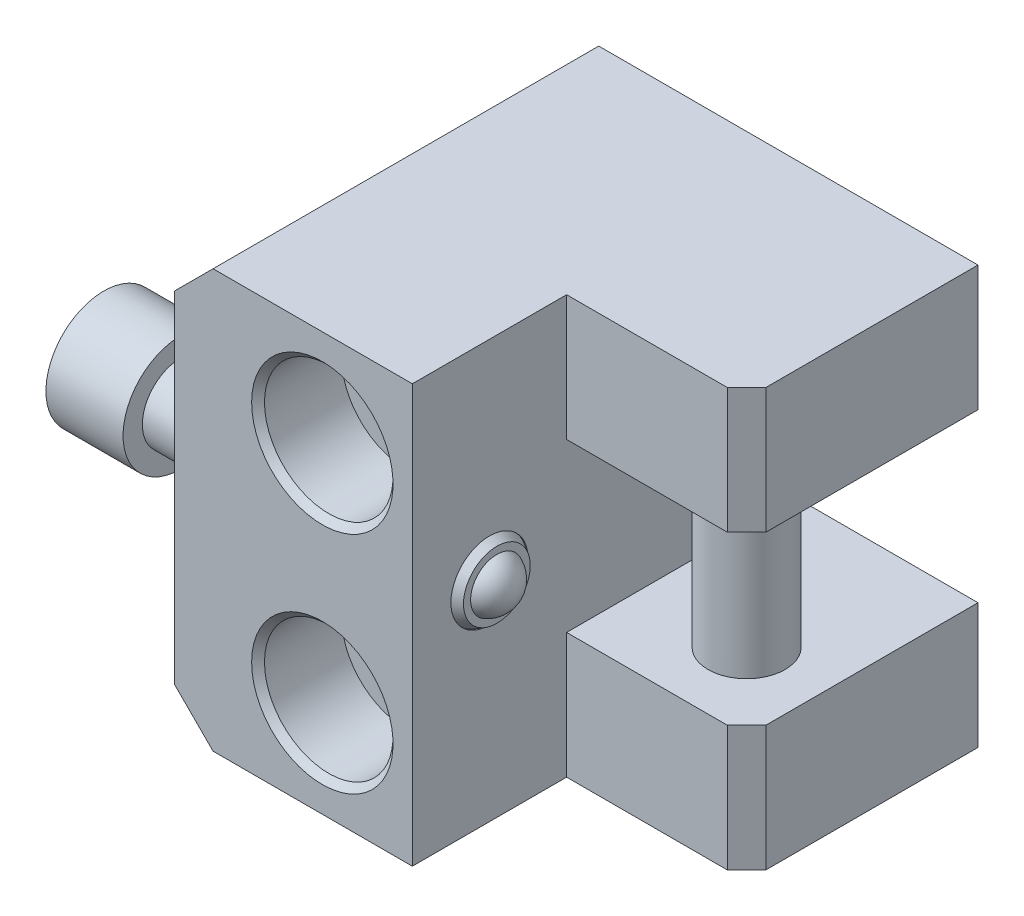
ISO-10303-21;
HEADER;
FILE_DESCRIPTION(('STEP AP214'),'2;1');
FILE_NAME('part.step','',(''),(''),'','','');
FILE_SCHEMA(('AUTOMOTIVE_DESIGN { 1 0 10303 214 1 1 1 1 }'));
ENDSEC;
DATA;
#1=APPLICATION_CONTEXT('core data for automotive mechanical design processes');
#2=APPLICATION_PROTOCOL_DEFINITION('international standard','automotive_design',2000,#1);
#3=PRODUCT_CONTEXT('',#1,'mechanical');
#4=PRODUCT('Part','Part','',(#3));
#5=PRODUCT_RELATED_PRODUCT_CATEGORY('part','',(#4));
#6=PRODUCT_DEFINITION_FORMATION('','',#4);
#7=PRODUCT_DEFINITION_CONTEXT('part definition',#1,'design');
#8=PRODUCT_DEFINITION('design','',#6,#7);
#9=PRODUCT_DEFINITION_SHAPE('','',#8);
#10=(LENGTH_UNIT() NAMED_UNIT(*) SI_UNIT(.MILLI.,.METRE.));
#11=(NAMED_UNIT(*) PLANE_ANGLE_UNIT() SI_UNIT($,.RADIAN.));
#12=(NAMED_UNIT(*) SI_UNIT($,.STERADIAN.) SOLID_ANGLE_UNIT());
#13=UNCERTAINTY_MEASURE_WITH_UNIT(LENGTH_MEASURE(1.E-05),#10,'distance_accuracy_value','');
#14=(GEOMETRIC_REPRESENTATION_CONTEXT(3) GLOBAL_UNCERTAINTY_ASSIGNED_CONTEXT((#13)) GLOBAL_UNIT_ASSIGNED_CONTEXT((#10,
#11,#12)) REPRESENTATION_CONTEXT('',''));
#15=CARTESIAN_POINT('',(0.,0.,0.));
#16=DIRECTION('',(0.,0.,1.));
#17=DIRECTION('',(1.,0.,0.));
#18=AXIS2_PLACEMENT_3D('',#15,#16,#17);
#19=CARTESIAN_POINT('',(-40.0000000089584,21.8385187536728,57.009842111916));
#20=DIRECTION('',(1.,4.10206021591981E-10,0.));
#21=DIRECTION('',(3.06687090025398E-11,-0.0747653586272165,0.99720115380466));
#22=AXIS2_PLACEMENT_3D('',#19,#20,#21);
#23=PLANE('',#22);
#24=DIRECTION('',(-3.69588857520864E-10,0.900984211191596,-0.433851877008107));
#25=VECTOR('',#24,1.);
#26=CARTESIAN_POINT('',(-40.0000000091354,22.2701767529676,51.2524985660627));
#27=LINE('',#26,#25);
#28=CARTESIAN_POINT('',(-40.0000000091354,22.2701767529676,51.2524985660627));
#29=VERTEX_POINT('',#28);
#30=CARTESIAN_POINT('',(-40.0000000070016,17.0683419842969,53.7573435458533));
#31=VERTEX_POINT('',#30);
#32=EDGE_CURVE('E162',#29,#31,#27,.F.);
#33=ORIENTED_EDGE('',*,*,#32,.F.);
#34=DIRECTION('',(-3.06687090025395E-11,0.074765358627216,-0.99720115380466));
#35=VECTOR('',#34,1.);
#36=CARTESIAN_POINT('',(-40.0000000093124,22.7018347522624,45.4951550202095));
#37=LINE('',#36,#35);
#38=CARTESIAN_POINT('',(-40.0000000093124,22.7018347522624,45.4951550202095));
#39=VERTEX_POINT('',#38);
#40=EDGE_CURVE('E177',#39,#29,#37,.F.);
#41=ORIENTED_EDGE('',*,*,#40,.F.);
#42=DIRECTION('',(-3.38920148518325E-10,0.82621885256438,0.563349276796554));
#43=VECTOR('',#42,1.);
#44=CARTESIAN_POINT('',(-40.0000000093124,22.7018347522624,45.4951550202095));
#45=LINE('',#44,#43);
#46=CARTESIAN_POINT('',(-40.0000000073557,17.9316579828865,42.2426564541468));
#47=VERTEX_POINT('',#46);
#48=EDGE_CURVE('E861',#39,#47,#45,.F.);
#49=ORIENTED_EDGE('',*,*,#48,.T.);
#50=DIRECTION('',(3.69588857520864E-10,-0.900984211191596,0.433851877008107));
#51=VECTOR('',#50,1.);
#52=CARTESIAN_POINT('',(-40.0000000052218,12.7298232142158,44.7475014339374));
#53=LINE('',#52,#51);
#54=CARTESIAN_POINT('',(-40.0000000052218,12.7298232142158,44.7475014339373));
#55=VERTEX_POINT('',#54);
#56=EDGE_CURVE('E864',#55,#47,#53,.F.);
#57=ORIENTED_EDGE('',*,*,#56,.F.);
#58=DIRECTION('',(-3.06687090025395E-11,0.074765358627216,-0.99720115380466));
#59=VECTOR('',#58,1.);
#60=CARTESIAN_POINT('',(-40.0000000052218,12.7298232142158,44.7475014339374));
#61=LINE('',#60,#59);
#62=CARTESIAN_POINT('',(-40.0000000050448,12.298165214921,50.5048449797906));
#63=VERTEX_POINT('',#62);
#64=EDGE_CURVE('E149',#55,#63,#61,.F.);
#65=ORIENTED_EDGE('',*,*,#64,.T.);
#66=DIRECTION('',(3.38920148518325E-10,-0.826218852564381,-0.563349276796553));
#67=VECTOR('',#66,1.);
#68=CARTESIAN_POINT('',(-40.0000000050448,12.298165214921,50.5048449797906));
#69=LINE('',#68,#67);
#70=EDGE_CURVE('E163',#63,#31,#69,.F.);
#71=ORIENTED_EDGE('',*,*,#70,.T.);
#72=EDGE_LOOP('',(#33,#41,#49,#57,#65,#71));
#73=FACE_BOUND('',#72,.T.);
#74=ADVANCED_FACE('F14',(#73),#23,.F.);
#75=CARTESIAN_POINT('',(-40.0000000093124,22.7018347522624,45.4951550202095));
#76=DIRECTION('',(-2.31088813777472E-10,0.563349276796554,-0.82621885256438));
#77=DIRECTION('',(-3.38920148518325E-10,0.82621885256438,0.563349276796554));
#78=AXIS2_PLACEMENT_3D('',#75,#76,#77);
#79=PLANE('',#78);
#80=DIRECTION('',(-3.38920148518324E-10,0.826218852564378,0.563349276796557));
#81=VECTOR('',#80,1.);
#82=CARTESIAN_POINT('',(-46.0000000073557,17.9316579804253,42.2426564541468));
#83=LINE('',#82,#81);
#84=CARTESIAN_POINT('',(-46.0000000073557,17.9316579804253,42.2426564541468));
#85=VERTEX_POINT('',#84);
#86=CARTESIAN_POINT('',(-46.0000000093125,22.7018347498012,45.4951550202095));
#87=VERTEX_POINT('',#86);
#88=EDGE_CURVE('E189',#85,#87,#83,.T.);
#89=ORIENTED_EDGE('',*,*,#88,.F.);
#90=DIRECTION('',(1.,4.10206021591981E-10,0.));
#91=VECTOR('',#90,1.);
#92=CARTESIAN_POINT('',(-40.0000000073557,17.9316579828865,42.2426564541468));
#93=LINE('',#92,#91);
#94=EDGE_CURVE('E859',#47,#85,#93,.F.);
#95=ORIENTED_EDGE('',*,*,#94,.F.);
#96=ORIENTED_EDGE('',*,*,#48,.F.);
#97=DIRECTION('',(1.,4.10206021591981E-10,0.));
#98=VECTOR('',#97,1.);
#99=CARTESIAN_POINT('',(-40.0000000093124,22.7018347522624,45.4951550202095));
#100=LINE('',#99,#98);
#101=EDGE_CURVE('E179',#87,#39,#100,.T.);
#102=ORIENTED_EDGE('',*,*,#101,.F.);
#103=EDGE_LOOP('',(#89,#95,#96,#102));
#104=FACE_BOUND('',#103,.T.);
#105=ADVANCED_FACE('F347',(#104),#79,.F.);
#106=CARTESIAN_POINT('',(-40.0000000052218,12.7298232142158,44.7475014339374));
#107=DIRECTION('',(-1.77969051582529E-10,0.433851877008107,0.900984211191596));
#108=DIRECTION('',(3.69588857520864E-10,-0.900984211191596,0.433851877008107));
#109=AXIS2_PLACEMENT_3D('',#106,#107,#108);
#110=PLANE('',#109);
#111=DIRECTION('',(1.,4.10206021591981E-10,0.));
#112=VECTOR('',#111,1.);
#113=CARTESIAN_POINT('',(-40.0000000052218,12.7298232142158,44.7475014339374));
#114=LINE('',#113,#112);
#115=CARTESIAN_POINT('',(-46.0000000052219,12.7298232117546,44.7475014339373));
#116=VERTEX_POINT('',#115);
#117=EDGE_CURVE('E866',#116,#55,#114,.T.);
#118=ORIENTED_EDGE('',*,*,#117,.T.);
#119=ORIENTED_EDGE('',*,*,#56,.T.);
#120=ORIENTED_EDGE('',*,*,#94,.T.);
#121=DIRECTION('',(-3.69588857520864E-10,0.900984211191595,-0.43385187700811));
#122=VECTOR('',#121,1.);
#123=CARTESIAN_POINT('',(-46.0000000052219,12.7298232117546,44.7475014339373));
#124=LINE('',#123,#122);
#125=EDGE_CURVE('E192',#116,#85,#124,.T.);
#126=ORIENTED_EDGE('',*,*,#125,.F.);
#127=EDGE_LOOP('',(#118,#119,#120,#126));
#128=FACE_BOUND('',#127,.T.);
#129=ADVANCED_FACE('F353',(#128),#110,.T.);
#130=CARTESIAN_POINT('',(-40.0000000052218,12.7298232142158,44.7475014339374));
#131=DIRECTION('',(4.0905786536E-10,-0.99720115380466,-0.074765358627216));
#132=DIRECTION('',(-3.06687090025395E-11,0.074765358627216,-0.99720115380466));
#133=AXIS2_PLACEMENT_3D('',#130,#131,#132);
#134=PLANE('',#133);
#135=DIRECTION('',(-3.06687090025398E-11,0.0747653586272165,-0.99720115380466));
#136=VECTOR('',#135,1.);
#137=CARTESIAN_POINT('',(-46.0000000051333,12.5139942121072,47.6261732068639));
#138=LINE('',#137,#136);
#139=CARTESIAN_POINT('',(-46.0000000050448,12.2981652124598,50.5048449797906));
#140=VERTEX_POINT('',#139);
#141=EDGE_CURVE('E195',#140,#116,#138,.T.);
#142=ORIENTED_EDGE('',*,*,#141,.F.);
#143=DIRECTION('',(1.,4.10206021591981E-10,0.));
#144=VECTOR('',#143,1.);
#145=CARTESIAN_POINT('',(-40.0000000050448,12.298165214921,50.5048449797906));
#146=LINE('',#145,#144);
#147=EDGE_CURVE('E869',#63,#140,#146,.F.);
#148=ORIENTED_EDGE('',*,*,#147,.F.);
#149=ORIENTED_EDGE('',*,*,#64,.F.);
#150=ORIENTED_EDGE('',*,*,#117,.F.);
#151=EDGE_LOOP('',(#142,#148,#149,#150));
#152=FACE_BOUND('',#151,.T.);
#153=ADVANCED_FACE('F359',(#152),#134,.F.);
#154=CARTESIAN_POINT('',(-40.0000000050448,12.298165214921,50.5048449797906));
#155=DIRECTION('',(2.31088813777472E-10,-0.563349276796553,0.826218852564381));
#156=DIRECTION('',(3.38920148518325E-10,-0.826218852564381,-0.563349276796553));
#157=AXIS2_PLACEMENT_3D('',#154,#155,#156);
#158=PLANE('',#157);
#159=DIRECTION('',(3.38920148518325E-10,-0.826218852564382,-0.563349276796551));
#160=VECTOR('',#159,1.);
#161=CARTESIAN_POINT('',(-46.0000000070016,17.0683419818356,53.7573435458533));
#162=LINE('',#161,#160);
#163=CARTESIAN_POINT('',(-46.0000000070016,17.0683419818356,53.7573435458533));
#164=VERTEX_POINT('',#163);
#165=EDGE_CURVE('E172',#164,#140,#162,.T.);
#166=ORIENTED_EDGE('',*,*,#165,.F.);
#167=DIRECTION('',(1.,4.10206021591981E-10,0.));
#168=VECTOR('',#167,1.);
#169=CARTESIAN_POINT('',(-40.0000000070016,17.0683419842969,53.7573435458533));
#170=LINE('',#169,#168);
#171=EDGE_CURVE('E169',#31,#164,#170,.F.);
#172=ORIENTED_EDGE('',*,*,#171,.F.);
#173=ORIENTED_EDGE('',*,*,#70,.F.);
#174=ORIENTED_EDGE('',*,*,#147,.T.);
#175=EDGE_LOOP('',(#166,#172,#173,#174));
#176=FACE_BOUND('',#175,.T.);
#177=ADVANCED_FACE('F170',(#176),#158,.F.);
#178=CARTESIAN_POINT('',(-40.0000000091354,22.2701767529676,51.2524985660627));
#179=DIRECTION('',(1.77969051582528E-10,-0.433851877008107,-0.900984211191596));
#180=DIRECTION('',(-3.69588857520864E-10,0.900984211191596,-0.433851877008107));
#181=AXIS2_PLACEMENT_3D('',#178,#179,#180);
#182=PLANE('',#181);
#183=DIRECTION('',(3.69588857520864E-10,-0.900984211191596,0.433851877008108));
#184=VECTOR('',#183,1.);
#185=CARTESIAN_POINT('',(-46.0000000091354,22.2701767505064,51.2524985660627));
#186=LINE('',#185,#184);
#187=CARTESIAN_POINT('',(-46.0000000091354,22.2701767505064,51.2524985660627));
#188=VERTEX_POINT('',#187);
#189=EDGE_CURVE('E183',#188,#164,#186,.T.);
#190=ORIENTED_EDGE('',*,*,#189,.F.);
#191=DIRECTION('',(1.,4.10206021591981E-10,0.));
#192=VECTOR('',#191,1.);
#193=CARTESIAN_POINT('',(-40.0000000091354,22.2701767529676,51.2524985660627));
#194=LINE('',#193,#192);
#195=EDGE_CURVE('E33',#188,#29,#194,.T.);
#196=ORIENTED_EDGE('',*,*,#195,.T.);
#197=ORIENTED_EDGE('',*,*,#32,.T.);
#198=ORIENTED_EDGE('',*,*,#171,.T.);
#199=EDGE_LOOP('',(#190,#196,#197,#198));
#200=FACE_BOUND('',#199,.T.);
#201=ADVANCED_FACE('F176',(#200),#182,.T.);
#202=CARTESIAN_POINT('',(-40.0000000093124,22.7018347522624,45.4951550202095));
#203=DIRECTION('',(4.0905786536E-10,-0.99720115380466,-0.074765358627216));
#204=DIRECTION('',(-3.06687090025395E-11,0.074765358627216,-0.99720115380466));
#205=AXIS2_PLACEMENT_3D('',#202,#203,#204);
#206=PLANE('',#205);
#207=ORIENTED_EDGE('',*,*,#101,.T.);
#208=ORIENTED_EDGE('',*,*,#40,.T.);
#209=ORIENTED_EDGE('',*,*,#195,.F.);
#210=DIRECTION('',(-3.06687090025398E-11,0.0747653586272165,-0.99720115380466));
#211=VECTOR('',#210,1.);
#212=CARTESIAN_POINT('',(-46.0000000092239,22.4860057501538,48.3738267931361));
#213=LINE('',#212,#211);
#214=EDGE_CURVE('E186',#87,#188,#213,.F.);
#215=ORIENTED_EDGE('',*,*,#214,.F.);
#216=EDGE_LOOP('',(#207,#208,#209,#215));
#217=FACE_BOUND('',#216,.T.);
#218=ADVANCED_FACE('F366',(#217),#206,.T.);
#219=CARTESIAN_POINT('',(-46.0000000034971,8.52518959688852,47.3271117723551));
#220=DIRECTION('',(-1.,-4.10206021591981E-10,0.));
#221=DIRECTION('',(-3.06687090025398E-11,0.0747653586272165,-0.99720115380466));
#222=AXIS2_PLACEMENT_3D('',#219,#220,#221);
#223=PLANE('',#222);
#224=CARTESIAN_POINT('',(-46.0000000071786,17.4999999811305,48.));
#225=DIRECTION('',(1.,4.10206021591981E-10,0.));
#226=DIRECTION('',(3.06687090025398E-11,-0.0747653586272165,0.99720115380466));
#227=AXIS2_PLACEMENT_3D('',#224,#225,#226);
#228=CIRCLE('',#227,9.);
#229=CARTESIAN_POINT('',(-46.0000000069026,16.8271117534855,56.9748103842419));
#230=VERTEX_POINT('',#229);
#231=EDGE_CURVE('E185',#230,#230,#228,.T.);
#232=ORIENTED_EDGE('',*,*,#231,.F.);
#233=EDGE_LOOP('',(#232));
#234=FACE_BOUND('',#233,.T.);
#235=ORIENTED_EDGE('',*,*,#214,.T.);
#236=ORIENTED_EDGE('',*,*,#189,.T.);
#237=ORIENTED_EDGE('',*,*,#165,.T.);
#238=ORIENTED_EDGE('',*,*,#141,.T.);
#239=ORIENTED_EDGE('',*,*,#125,.T.);
#240=ORIENTED_EDGE('',*,*,#88,.T.);
#241=EDGE_LOOP('',(#235,#236,#237,#238,#239,#240));
#242=FACE_BOUND('',#241,.T.);
#243=ADVANCED_FACE('F211',(#234,#242),#223,.T.);
#244=CARTESIAN_POINT('',(25.9999999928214,17.5000000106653,48.));
#245=DIRECTION('',(1.,4.10206021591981E-10,0.));
#246=DIRECTION('',(3.06687090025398E-11,-0.0747653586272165,0.99720115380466));
#247=AXIS2_PLACEMENT_3D('',#244,#245,#246);
#248=CYLINDRICAL_SURFACE('',#247,9.);
#249=ORIENTED_EDGE('',*,*,#231,.T.);
#250=EDGE_LOOP('',(#249));
#251=FACE_BOUND('',#250,.T.);
#252=CARTESIAN_POINT('',(-34.0000000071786,17.4999999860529,48.));
#253=DIRECTION('',(1.,4.10206021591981E-10,0.));
#254=DIRECTION('',(3.06687090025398E-11,-0.0747653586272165,0.99720115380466));
#255=AXIS2_PLACEMENT_3D('',#252,#253,#254);
#256=CIRCLE('',#255,9.);
#257=CARTESIAN_POINT('',(-34.0000000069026,16.827111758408,56.9748103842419));
#258=VERTEX_POINT('',#257);
#259=EDGE_CURVE('E223',#258,#258,#256,.T.);
#260=ORIENTED_EDGE('',*,*,#259,.F.);
#261=EDGE_LOOP('',(#260));
#262=FACE_BOUND('',#261,.T.);
#263=ADVANCED_FACE('F213',(#251,#262),#248,.T.);
#264=CARTESIAN_POINT('',(-34.0000000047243,11.516793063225,47.5514078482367));
#265=DIRECTION('',(1.,4.10206021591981E-10,0.));
#266=DIRECTION('',(3.06687090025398E-11,-0.0747653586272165,0.99720115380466));
#267=AXIS2_PLACEMENT_3D('',#264,#265,#266);
#268=PLANE('',#267);
#269=CARTESIAN_POINT('',(-34.0000000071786,17.4999999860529,48.));
#270=DIRECTION('',(1.,4.10206021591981E-10,0.));
#271=DIRECTION('',(3.06687090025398E-11,-0.0747653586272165,0.99720115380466));
#272=AXIS2_PLACEMENT_3D('',#269,#270,#271);
#273=CIRCLE('',#272,6.);
#274=CARTESIAN_POINT('',(-34.0000000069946,17.0514078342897,53.983206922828));
#275=VERTEX_POINT('',#274);
#276=EDGE_CURVE('E784',#275,#275,#273,.T.);
#277=ORIENTED_EDGE('',*,*,#276,.F.);
#278=EDGE_LOOP('',(#277));
#279=FACE_BOUND('',#278,.T.);
#280=ORIENTED_EDGE('',*,*,#259,.T.);
#281=EDGE_LOOP('',(#280));
#282=FACE_BOUND('',#281,.T.);
#283=ADVANCED_FACE('F230',(#279,#282),#268,.T.);
#284=CARTESIAN_POINT('',(25.9999999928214,17.5000000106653,48.));
#285=DIRECTION('',(1.,4.10206021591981E-10,0.));
#286=DIRECTION('',(3.06687090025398E-11,-0.0747653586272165,0.99720115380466));
#287=AXIS2_PLACEMENT_3D('',#284,#285,#286);
#288=CYLINDRICAL_SURFACE('',#287,6.);
#289=ORIENTED_EDGE('',*,*,#276,.T.);
#290=EDGE_LOOP('',(#289));
#291=FACE_BOUND('',#290,.T.);
#292=CARTESIAN_POINT('',(-23.0000000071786,17.4999999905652,48.));
#293=DIRECTION('',(-1.,-4.10206857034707E-10,0.));
#294=DIRECTION('',(0.,0.,-1.));
#295=AXIS2_PLACEMENT_3D('',#292,#293,#294);
#296=CIRCLE('',#295,6.);
#297=CARTESIAN_POINT('',(-23.0000000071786,17.4999999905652,42.));
#298=VERTEX_POINT('',#297);
#299=EDGE_CURVE('E9',#298,#298,#296,.T.);
#300=ORIENTED_EDGE('',*,*,#299,.T.);
#301=EDGE_LOOP('',(#300));
#302=FACE_BOUND('',#301,.T.);
#303=ADVANCED_FACE('F209',(#291,#302),#288,.T.);
#304=CARTESIAN_POINT('',(13.6499999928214,17.5000000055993,48.));
#305=DIRECTION('',(4.0905786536E-10,-0.99720115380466,-0.0747653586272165));
#306=DIRECTION('',(-1.,-4.10205932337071E-10,0.));
#307=AXIS2_PLACEMENT_3D('',#304,#305,#306);
#308=SPHERICAL_SURFACE('',#307,4.35);
#309=CARTESIAN_POINT('',(15.1499999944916,13.4282309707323,47.694718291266));
#310=CARTESIAN_POINT('',(15.1499999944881,13.4368030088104,47.580395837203));
#311=CARTESIAN_POINT('',(15.1499999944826,13.4501942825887,47.466413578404));
#312=CARTESIAN_POINT('',(15.1499999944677,13.486522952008,47.2399594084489));
#313=CARTESIAN_POINT('',(15.1499999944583,13.5094631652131,47.1274879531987));
#314=CARTESIAN_POINT('',(15.1499999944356,13.5647769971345,46.9046881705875));
#315=CARTESIAN_POINT('',(15.1499999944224,13.59716556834,46.7943635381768));
#316=CARTESIAN_POINT('',(15.149999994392,13.6711411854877,46.5767737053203));
#317=CARTESIAN_POINT('',(15.1499999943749,13.7127356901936,46.4695110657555));
#318=CARTESIAN_POINT('',(15.1499999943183,13.8507433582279,46.153927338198));
#319=CARTESIAN_POINT('',(15.1499999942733,13.9605149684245,45.9512719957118));
#320=CARTESIAN_POINT('',(15.1499999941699,14.2125715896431,45.5672937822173));
#321=CARTESIAN_POINT('',(15.1499999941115,14.3548578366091,45.3859717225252));
#322=CARTESIAN_POINT('',(15.1499999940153,14.5894473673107,45.1339185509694));
#323=CARTESIAN_POINT('',(15.1499999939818,14.6712309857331,45.0531762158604));
#324=CARTESIAN_POINT('',(15.149999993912,14.8412475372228,44.898922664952));
#325=CARTESIAN_POINT('',(15.1499999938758,14.9294741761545,44.8254045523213));
#326=CARTESIAN_POINT('',(15.149999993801,15.111841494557,44.6860324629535));
#327=CARTESIAN_POINT('',(15.1499999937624,15.2059848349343,44.6201819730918));
#328=CARTESIAN_POINT('',(15.149999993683,15.3995053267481,44.4966295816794));
#329=CARTESIAN_POINT('',(15.1499999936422,15.4988836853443,44.4389295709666));
#330=CARTESIAN_POINT('',(15.1499999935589,15.7021223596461,44.3321254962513));
#331=CARTESIAN_POINT('',(15.1499999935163,15.805981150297,44.2830185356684));
#332=CARTESIAN_POINT('',(15.1499999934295,16.017473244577,44.1937136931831));
#333=CARTESIAN_POINT('',(15.1499999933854,16.1251079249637,44.1535191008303));
#334=CARTESIAN_POINT('',(15.1499999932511,16.4524586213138,44.0468114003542));
#335=CARTESIAN_POINT('',(15.149999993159,16.6768444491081,43.9940573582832));
#336=CARTESIAN_POINT('',(15.1499999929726,17.1311762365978,43.9270079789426));
#337=CARTESIAN_POINT('',(15.1499999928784,17.3611222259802,43.9127128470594));
#338=CARTESIAN_POINT('',(15.1499999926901,17.820153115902,43.9229047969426));
#339=CARTESIAN_POINT('',(15.149999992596,18.0492380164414,43.947391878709));
#340=CARTESIAN_POINT('',(15.1499999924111,18.5001461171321,44.0345404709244));
#341=CARTESIAN_POINT('',(15.1499999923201,18.7219693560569,44.0972017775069));
#342=CARTESIAN_POINT('',(15.1499999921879,19.0442612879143,44.2183336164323));
#343=CARTESIAN_POINT('',(15.1499999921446,19.1500058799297,44.2632659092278));
#344=CARTESIAN_POINT('',(15.1499999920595,19.3573258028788,44.3618697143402));
#345=CARTESIAN_POINT('',(15.1499999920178,19.4589026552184,44.4155380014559));
#346=CARTESIAN_POINT('',(15.1499999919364,19.6572005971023,44.5312574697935));
#347=CARTESIAN_POINT('',(15.1499999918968,19.7539200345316,44.5933114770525));
#348=CARTESIAN_POINT('',(15.1499999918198,19.9417660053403,44.7253314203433));
#349=CARTESIAN_POINT('',(15.1499999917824,20.0328938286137,44.7952955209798));
#350=CARTESIAN_POINT('',(15.1499999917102,20.2088954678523,44.9426245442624));
#351=CARTESIAN_POINT('',(15.1499999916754,20.2937720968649,45.0199861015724));
#352=CARTESIAN_POINT('',(15.1499999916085,20.4567746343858,45.181633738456));
#353=CARTESIAN_POINT('',(15.1499999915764,20.5348939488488,45.2659264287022));
#354=CARTESIAN_POINT('',(15.1499999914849,20.7580650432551,45.5281433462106));
#355=CARTESIAN_POINT('',(15.1499999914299,20.892163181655,45.7156020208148));
#356=CARTESIAN_POINT('',(15.1499999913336,21.1269287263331,46.1103892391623));
#357=CARTESIAN_POINT('',(15.1499999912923,21.2275974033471,46.3177170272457));
#358=CARTESIAN_POINT('',(15.1499999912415,21.3514620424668,46.6391151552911));
#359=CARTESIAN_POINT('',(15.1499999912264,21.3882547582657,46.7481182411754));
#360=CARTESIAN_POINT('',(15.1499999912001,21.4524998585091,46.9687770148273));
#361=CARTESIAN_POINT('',(15.1499999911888,21.4799598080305,47.0804304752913));
#362=CARTESIAN_POINT('',(15.1499999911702,21.5253302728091,47.3054657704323));
#363=CARTESIAN_POINT('',(15.1499999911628,21.5432558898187,47.4188445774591));
#364=CARTESIAN_POINT('',(15.1499999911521,21.5694977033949,47.6466880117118));
#365=CARTESIAN_POINT('',(15.1499999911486,21.5778167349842,47.7611523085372));
#366=CARTESIAN_POINT('',(15.1499999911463,21.5834868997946,47.9473554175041));
#367=CARTESIAN_POINT('',(15.1499999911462,21.5837813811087,48.0190174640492));
#368=CARTESIAN_POINT('',(15.1499999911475,21.5806009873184,48.162257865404));
#369=CARTESIAN_POINT('',(15.1499999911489,21.5771261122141,48.2338362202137));
#370=CARTESIAN_POINT('',(15.1499999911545,21.5631970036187,48.4196041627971));
#371=CARTESIAN_POINT('',(15.1499999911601,21.5498057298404,48.5335864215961));
#372=CARTESIAN_POINT('',(15.1499999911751,21.5134770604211,48.7600405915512));
#373=CARTESIAN_POINT('',(15.1499999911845,21.490536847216,48.8725120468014));
#374=CARTESIAN_POINT('',(15.1499999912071,21.4352230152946,49.0953118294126));
#375=CARTESIAN_POINT('',(15.1499999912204,21.4028344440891,49.2056364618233));
#376=CARTESIAN_POINT('',(15.1499999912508,21.3288588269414,49.4232262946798));
#377=CARTESIAN_POINT('',(15.1499999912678,21.2872643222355,49.5304889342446));
#378=CARTESIAN_POINT('',(15.1499999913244,21.1492566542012,49.8460726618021));
#379=CARTESIAN_POINT('',(15.1499999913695,21.0394850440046,50.0487280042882));
#380=CARTESIAN_POINT('',(15.1499999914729,20.787428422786,50.4327062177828));
#381=CARTESIAN_POINT('',(15.1499999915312,20.64514217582,50.614028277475));
#382=CARTESIAN_POINT('',(15.1499999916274,20.4105526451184,50.8660814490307));
#383=CARTESIAN_POINT('',(15.149999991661,20.328769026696,50.9468237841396));
#384=CARTESIAN_POINT('',(15.1499999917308,20.1587524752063,51.101077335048));
#385=CARTESIAN_POINT('',(15.1499999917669,20.0705258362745,51.1745954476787));
#386=CARTESIAN_POINT('',(15.1499999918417,19.8881585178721,51.3139675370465));
#387=CARTESIAN_POINT('',(15.1499999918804,19.7940151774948,51.3798180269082));
#388=CARTESIAN_POINT('',(15.1499999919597,19.600494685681,51.5033704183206));
#389=CARTESIAN_POINT('',(15.1499999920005,19.5011163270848,51.5610704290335));
#390=CARTESIAN_POINT('',(15.1499999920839,19.2978776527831,51.6678745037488));
#391=CARTESIAN_POINT('',(15.1499999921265,19.1940188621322,51.7169814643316));
#392=CARTESIAN_POINT('',(15.1499999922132,18.9825267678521,51.8062863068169));
#393=CARTESIAN_POINT('',(15.1499999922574,18.8748920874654,51.8464808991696));
#394=CARTESIAN_POINT('',(15.1499999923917,18.5475413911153,51.9531885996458));
#395=CARTESIAN_POINT('',(15.1499999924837,18.3231555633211,52.0059426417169));
#396=CARTESIAN_POINT('',(15.1499999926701,17.8688237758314,52.0729920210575));
#397=CARTESIAN_POINT('',(15.1499999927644,17.638877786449,52.0872871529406));
#398=CARTESIAN_POINT('',(15.1499999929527,17.1798468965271,52.0770952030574));
#399=CARTESIAN_POINT('',(15.1499999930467,16.9507619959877,52.0526081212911));
#400=CARTESIAN_POINT('',(15.1499999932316,16.4998538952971,51.9654595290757));
#401=CARTESIAN_POINT('',(15.1499999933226,16.2780306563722,51.9027982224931));
#402=CARTESIAN_POINT('',(15.1499999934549,15.9557387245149,51.7816663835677));
#403=CARTESIAN_POINT('',(15.1499999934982,15.8499941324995,51.7367340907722));
#404=CARTESIAN_POINT('',(15.1499999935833,15.6426742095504,51.6381302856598));
#405=CARTESIAN_POINT('',(15.1499999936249,15.5410973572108,51.5844619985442));
#406=CARTESIAN_POINT('',(15.1499999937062,15.3427994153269,51.4687425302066));
#407=CARTESIAN_POINT('',(15.1499999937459,15.2460799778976,51.4066885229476));
#408=CARTESIAN_POINT('',(15.149999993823,15.0582340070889,51.2746685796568));
#409=CARTESIAN_POINT('',(15.1499999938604,14.9671061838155,51.2047044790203));
#410=CARTESIAN_POINT('',(15.1499999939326,14.7911045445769,51.0573754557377));
#411=CARTESIAN_POINT('',(15.1499999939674,14.7062279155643,50.9800138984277));
#412=CARTESIAN_POINT('',(15.1499999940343,14.5432253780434,50.818366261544));
#413=CARTESIAN_POINT('',(15.1499999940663,14.4651060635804,50.7340735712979));
#414=CARTESIAN_POINT('',(15.1499999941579,14.2419349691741,50.4718566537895));
#415=CARTESIAN_POINT('',(15.1499999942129,14.1078368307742,50.2843979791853));
#416=CARTESIAN_POINT('',(15.1499999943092,13.8730712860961,49.8896107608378));
#417=CARTESIAN_POINT('',(15.1499999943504,13.7724026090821,49.6822829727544));
#418=CARTESIAN_POINT('',(15.1499999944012,13.6485379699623,49.360884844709));
#419=CARTESIAN_POINT('',(15.1499999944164,13.6117452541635,49.2518817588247));
#420=CARTESIAN_POINT('',(15.1499999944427,13.54750015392,49.0312229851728));
#421=CARTESIAN_POINT('',(15.149999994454,13.5200402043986,48.9195695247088));
#422=CARTESIAN_POINT('',(15.1499999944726,13.47466973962,48.6945342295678));
#423=CARTESIAN_POINT('',(15.14999999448,13.4567441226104,48.581155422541));
#424=CARTESIAN_POINT('',(15.1499999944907,13.4305023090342,48.3533119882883));
#425=CARTESIAN_POINT('',(15.1499999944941,13.422183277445,48.2388476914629));
#426=CARTESIAN_POINT('',(15.1499999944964,13.4165131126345,48.052644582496));
#427=CARTESIAN_POINT('',(15.1499999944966,13.4162186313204,47.9809825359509));
#428=CARTESIAN_POINT('',(15.1499999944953,13.4193990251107,47.8377421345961));
#429=CARTESIAN_POINT('',(15.1499999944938,13.4228739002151,47.7661637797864));
#430=CARTESIAN_POINT('',(15.1499999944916,13.4282309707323,47.694718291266));
#431=B_SPLINE_CURVE_WITH_KNOTS('',3,(#309,#310,#311,#312,#313,#314,#315,#316,#317,#318,#319,
#320,#321,#322,#323,#324,#325,#326,#327,#328,#329,#330,#331,#332,#333,#334,#335,#336,#337,#338,
#339,#340,#341,#342,#343,#344,#345,#346,#347,#348,#349,#350,#351,#352,#353,#354,#355,#356,#357,
#358,#359,#360,#361,#362,#363,#364,#365,#366,#367,#368,#369,#370,#371,#372,#373,#374,#375,#376,
#377,#378,#379,#380,#381,#382,#383,#384,#385,#386,#387,#388,#389,#390,#391,#392,#393,#394,#395,
#396,#397,#398,#399,#400,#401,#402,#403,#404,#405,#406,#407,#408,#409,#410,#411,#412,#413,#414,
#415,#416,#417,#418,#419,#420,#421,#422,#423,#424,#425,#426,#427,#428,#429,#430),.UNSPECIFIED.,
.T.,.F.,(4,2,2,2,2,2,2,2,2,2,2,2,2,2,2,2,2,2,2,2,2,2,2,2,2,2,2,2,2,2,2,2,2,2,2,2,2,2,2,2,2,2,2,
2,2,2,2,2,2,2,2,2,2,2,2,2,2,2,2,2,4),(0.,0.343864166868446,0.687829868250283,1.03234289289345,
1.37713607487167,2.06507885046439,2.75304778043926,3.09748299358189,3.44158611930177,
3.78584512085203,4.13018385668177,4.47440629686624,4.81875557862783,5.50670775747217,
6.19466361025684,6.88261946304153,7.57057164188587,7.91492092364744,8.2591433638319,
8.60348209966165,8.94774110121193,9.29184422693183,9.63627944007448,10.3242483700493,
11.012191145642,11.3569843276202,11.7014973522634,12.0454630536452,12.3893272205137,
12.6042241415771,12.8191210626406,13.162985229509,13.5069509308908,13.851463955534,
14.1962571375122,14.884199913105,15.5721688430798,15.9166040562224,16.2607071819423,
16.6049661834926,16.9493049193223,17.2935273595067,17.6378766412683,18.3258288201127,
19.0137846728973,19.701740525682,20.3896927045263,20.7340419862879,21.0782644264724,
21.4226031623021,21.7668621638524,22.1109652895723,22.4554005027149,23.1433694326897,
23.8313122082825,24.1761053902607,24.5206184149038,24.8645841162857,25.2084482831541,
25.4233452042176,25.638242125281),.UNSPECIFIED.);
#432=CARTESIAN_POINT('',(15.1499999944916,13.4282309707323,47.694718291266));
#433=VERTEX_POINT('',#432);
#434=EDGE_CURVE('E216',#433,#433,#431,.T.);
#435=ORIENTED_EDGE('',*,*,#434,.T.);
#436=EDGE_LOOP('',(#435));
#437=FACE_BOUND('',#436,.T.);
#438=ADVANCED_FACE('F203',(#437),#308,.T.);
#439=CARTESIAN_POINT('',(15.1499999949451,12.3228211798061,47.611839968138));
#440=DIRECTION('',(-1.,-4.10206021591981E-10,0.));
#441=DIRECTION('',(-3.06687090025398E-11,0.0747653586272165,-0.99720115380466));
#442=AXIS2_PLACEMENT_3D('',#439,#440,#441);
#443=PLANE('',#442);
#444=CARTESIAN_POINT('',(15.1499999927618,17.5000000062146,48.));
#445=DIRECTION('',(-1.,-4.10206064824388E-10,0.));
#446=DIRECTION('',(-3.06692872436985E-11,0.0747653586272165,-0.99720115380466));
#447=AXIS2_PLACEMENT_3D('',#444,#445,#446);
#448=CIRCLE('',#447,5.1917096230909);
#449=CARTESIAN_POINT('',(15.1499999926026,17.8881600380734,42.822821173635));
#450=VERTEX_POINT('',#449);
#451=EDGE_CURVE('E786',#450,#450,#448,.T.);
#452=ORIENTED_EDGE('',*,*,#451,.F.);
#453=EDGE_LOOP('',(#452));
#454=FACE_BOUND('',#453,.T.);
#455=ORIENTED_EDGE('',*,*,#434,.F.);
#456=EDGE_LOOP('',(#455));
#457=FACE_BOUND('',#456,.T.);
#458=ADVANCED_FACE('F208',(#454,#457),#443,.F.);
#459=CARTESIAN_POINT('',(13.7499999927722,17.5000000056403,48.));
#460=DIRECTION('',(-1.,-4.10206064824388E-10,0.));
#461=DIRECTION('',(-3.06692872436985E-11,0.0747653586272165,-0.99720115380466));
#462=AXIS2_PLACEMENT_3D('',#459,#460,#461);
#463=CONICAL_SURFACE('',#462,5.99999999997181,0.523598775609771);
#464=CARTESIAN_POINT('',(13.7499999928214,17.5000000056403,48.));
#465=DIRECTION('',(1.,4.10206021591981E-10,0.));
#466=DIRECTION('',(3.06687090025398E-11,-0.0747653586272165,0.99720115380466));
#467=AXIS2_PLACEMENT_3D('',#464,#465,#466);
#468=CIRCLE('',#467,6.);
#469=CARTESIAN_POINT('',(13.7499999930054,17.051407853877,53.983206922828));
#470=VERTEX_POINT('',#469);
#471=EDGE_CURVE('E24',#470,#470,#468,.F.);
#472=ORIENTED_EDGE('',*,*,#471,.F.);
#473=EDGE_LOOP('',(#472));
#474=FACE_BOUND('',#473,.T.);
#475=ORIENTED_EDGE('',*,*,#451,.T.);
#476=EDGE_LOOP('',(#475));
#477=FACE_BOUND('',#476,.T.);
#478=ADVANCED_FACE('F228',(#474,#477),#463,.T.);
#479=CARTESIAN_POINT('',(-10.0000000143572,34.9999999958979,46.997116));
#480=DIRECTION('',(0.,0.,-1.));
#481=DIRECTION('',(1.,4.10206857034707E-10,0.));
#482=AXIS2_PLACEMENT_3D('',#479,#480,#481);
#483=PLANE('',#482);
#484=CARTESIAN_POINT('',(-1.43572376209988E-08,35.,46.997116));
#485=DIRECTION('',(0.,0.,1.));
#486=DIRECTION('',(-1.,-4.10206857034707E-10,0.));
#487=AXIS2_PLACEMENT_3D('',#484,#485,#486);
#488=CIRCLE('',#487,6.5);
#489=CARTESIAN_POINT('',(-6.50000001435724,34.9999999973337,46.997116));
#490=VERTEX_POINT('',#489);
#491=EDGE_CURVE('E728',#490,#490,#488,.T.);
#492=ORIENTED_EDGE('',*,*,#491,.F.);
#493=EDGE_LOOP('',(#492));
#494=FACE_BOUND('',#493,.T.);
#495=CARTESIAN_POINT('',(-1.43572376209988E-08,35.,46.997116));
#496=DIRECTION('',(0.,0.,1.));
#497=DIRECTION('',(-1.,-4.10206857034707E-10,0.));
#498=AXIS2_PLACEMENT_3D('',#495,#496,#497);
#499=CIRCLE('',#498,10.);
#500=CARTESIAN_POINT('',(-10.0000000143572,34.9999999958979,46.997116));
#501=VERTEX_POINT('',#500);
#502=EDGE_CURVE('E731',#501,#501,#499,.T.);
#503=ORIENTED_EDGE('',*,*,#502,.T.);
#504=EDGE_LOOP('',(#503));
#505=FACE_BOUND('',#504,.T.);
#506=ADVANCED_FACE('F236',(#494,#505),#483,.F.);
#507=CARTESIAN_POINT('',(-10.,-4.10210754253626E-09,46.997116));
#508=DIRECTION('',(0.,0.,-1.));
#509=DIRECTION('',(1.,4.10206857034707E-10,0.));
#510=AXIS2_PLACEMENT_3D('',#507,#508,#509);
#511=PLANE('',#510);
#512=CARTESIAN_POINT('',(0.,0.,46.997116));
#513=DIRECTION('',(0.,0.,1.));
#514=DIRECTION('',(-1.,-4.10206857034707E-10,0.));
#515=AXIS2_PLACEMENT_3D('',#512,#513,#514);
#516=CIRCLE('',#515,6.5);
#517=CARTESIAN_POINT('',(-6.5,-2.66638273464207E-09,46.997116));
#518=VERTEX_POINT('',#517);
#519=EDGE_CURVE('E746',#518,#518,#516,.T.);
#520=ORIENTED_EDGE('',*,*,#519,.F.);
#521=EDGE_LOOP('',(#520));
#522=FACE_BOUND('',#521,.T.);
#523=CARTESIAN_POINT('',(0.,0.,46.997116));
#524=DIRECTION('',(0.,0.,1.));
#525=DIRECTION('',(-1.,-4.10206857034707E-10,0.));
#526=AXIS2_PLACEMENT_3D('',#523,#524,#525);
#527=CIRCLE('',#526,10.);
#528=CARTESIAN_POINT('',(-10.,-4.10210673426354E-09,46.997116));
#529=VERTEX_POINT('',#528);
#530=EDGE_CURVE('E749',#529,#529,#527,.T.);
#531=ORIENTED_EDGE('',*,*,#530,.T.);
#532=EDGE_LOOP('',(#531));
#533=FACE_BOUND('',#532,.T.);
#534=ADVANCED_FACE('F289',(#522,#533),#511,.F.);
#535=CARTESIAN_POINT('',(29.9999999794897,50.0000000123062,24.));
#536=DIRECTION('',(4.10206948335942E-10,-1.,0.));
#537=DIRECTION('',(1.,4.10206948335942E-10,0.));
#538=AXIS2_PLACEMENT_3D('',#535,#536,#537);
#539=CYLINDRICAL_SURFACE('',#538,6.);
#540=CARTESIAN_POINT('',(29.9999999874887,30.5000000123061,24.));
#541=DIRECTION('',(-4.10207011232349E-10,1.,0.));
#542=DIRECTION('',(-1.,-4.10207011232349E-10,0.));
#543=AXIS2_PLACEMENT_3D('',#540,#541,#542);
#544=CIRCLE('',#543,6.);
#545=CARTESIAN_POINT('',(23.9999999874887,30.5000000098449,24.));
#546=VERTEX_POINT('',#545);
#547=EDGE_CURVE('E642',#546,#546,#544,.T.);
#548=ORIENTED_EDGE('',*,*,#547,.F.);
#549=EDGE_LOOP('',(#548));
#550=FACE_BOUND('',#549,.T.);
#551=CARTESIAN_POINT('',(29.9999999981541,4.50000001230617,24.));
#552=DIRECTION('',(4.10207011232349E-10,-1.,0.));
#553=DIRECTION('',(1.,4.10207011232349E-10,0.));
#554=AXIS2_PLACEMENT_3D('',#551,#552,#553);
#555=CIRCLE('',#554,6.);
#556=CARTESIAN_POINT('',(35.9999999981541,4.50000001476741,24.));
#557=VERTEX_POINT('',#556);
#558=EDGE_CURVE('E18',#557,#557,#555,.T.);
#559=ORIENTED_EDGE('',*,*,#558,.F.);
#560=EDGE_LOOP('',(#559));
#561=FACE_BOUND('',#560,.T.);
#562=ADVANCED_FACE('F16',(#550,#561),#539,.T.);
#563=CARTESIAN_POINT('',(-1.43572376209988E-08,35.,60.));
#564=DIRECTION('',(0.,0.,1.));
#565=DIRECTION('',(-1.,-4.10206857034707E-10,0.));
#566=AXIS2_PLACEMENT_3D('',#563,#564,#565);
#567=CYLINDRICAL_SURFACE('',#566,6.5);
#568=CARTESIAN_POINT('',(-1.43572376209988E-08,35.,1.));
#569=DIRECTION('',(0.,0.,1.));
#570=DIRECTION('',(-1.,-4.10206857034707E-10,0.));
#571=AXIS2_PLACEMENT_3D('',#568,#569,#570);
#572=CIRCLE('',#571,6.5);
#573=CARTESIAN_POINT('',(-6.50000001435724,34.9999999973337,1.));
#574=VERTEX_POINT('',#573);
#575=EDGE_CURVE('E725',#574,#574,#572,.T.);
#576=ORIENTED_EDGE('',*,*,#575,.F.);
#577=EDGE_LOOP('',(#576));
#578=FACE_BOUND('',#577,.T.);
#579=ORIENTED_EDGE('',*,*,#491,.T.);
#580=EDGE_LOOP('',(#579));
#581=FACE_BOUND('',#580,.T.);
#582=ADVANCED_FACE('F295',(#578,#581),#567,.F.);
#583=CARTESIAN_POINT('',(0.,0.,60.));
#584=DIRECTION('',(0.,0.,1.));
#585=DIRECTION('',(-1.,-4.10206857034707E-10,0.));
#586=AXIS2_PLACEMENT_3D('',#583,#584,#585);
#587=CYLINDRICAL_SURFACE('',#586,6.5);
#588=CARTESIAN_POINT('',(0.,0.,1.));
#589=DIRECTION('',(0.,0.,1.));
#590=DIRECTION('',(-1.,-4.10206857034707E-10,0.));
#591=AXIS2_PLACEMENT_3D('',#588,#589,#590);
#592=CIRCLE('',#591,6.5);
#593=CARTESIAN_POINT('',(-6.5,-2.66638273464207E-09,1.));
#594=VERTEX_POINT('',#593);
#595=EDGE_CURVE('E743',#594,#594,#592,.T.);
#596=ORIENTED_EDGE('',*,*,#595,.F.);
#597=EDGE_LOOP('',(#596));
#598=FACE_BOUND('',#597,.T.);
#599=ORIENTED_EDGE('',*,*,#519,.T.);
#600=EDGE_LOOP('',(#599));
#601=FACE_BOUND('',#600,.T.);
#602=ADVANCED_FACE('F246',(#598,#601),#587,.F.);
#603=CARTESIAN_POINT('',(38.9999999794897,50.000000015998,36.));
#604=DIRECTION('',(0.707106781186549,2.90060125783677E-10,0.707106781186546));
#605=DIRECTION('',(-0.707106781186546,-2.90060050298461E-10,0.707106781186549));
#606=AXIS2_PLACEMENT_3D('',#603,#604,#605);
#607=PLANE('',#606);
#608=DIRECTION('',(-0.707106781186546,-2.90060050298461E-10,0.707106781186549));
#609=VECTOR('',#608,1.);
#610=CARTESIAN_POINT('',(39.0000000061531,-14.999999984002,36.));
#611=LINE('',#610,#609);
#612=CARTESIAN_POINT('',(42.0000000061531,-14.9999999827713,33.));
#613=VERTEX_POINT('',#612);
#614=CARTESIAN_POINT('',(39.0000000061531,-14.999999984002,36.));
#615=VERTEX_POINT('',#614);
#616=EDGE_CURVE('E640',#613,#615,#611,.T.);
#617=ORIENTED_EDGE('',*,*,#616,.F.);
#618=DIRECTION('',(4.10206963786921E-10,-1.,0.));
#619=VECTOR('',#618,1.);
#620=CARTESIAN_POINT('',(42.0000000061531,-14.9999999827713,33.));
#621=LINE('',#620,#619);
#622=CARTESIAN_POINT('',(41.999999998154,4.50000001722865,33.));
#623=VERTEX_POINT('',#622);
#624=EDGE_CURVE('E140',#623,#613,#621,.T.);
#625=ORIENTED_EDGE('',*,*,#624,.F.);
#626=DIRECTION('',(0.707106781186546,2.90060125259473E-10,-0.707106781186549));
#627=VECTOR('',#626,1.);
#628=CARTESIAN_POINT('',(38.999999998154,4.50000001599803,36.));
#629=LINE('',#628,#627);
#630=CARTESIAN_POINT('',(38.999999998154,4.50000001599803,36.));
#631=VERTEX_POINT('',#630);
#632=EDGE_CURVE('E134',#631,#623,#629,.T.);
#633=ORIENTED_EDGE('',*,*,#632,.F.);
#634=DIRECTION('',(-4.10206963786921E-10,1.,0.));
#635=VECTOR('',#634,1.);
#636=CARTESIAN_POINT('',(38.999999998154,4.50000001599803,36.));
#637=LINE('',#636,#635);
#638=EDGE_CURVE('E644',#615,#631,#637,.T.);
#639=ORIENTED_EDGE('',*,*,#638,.F.);
#640=EDGE_LOOP('',(#617,#625,#633,#639));
#641=FACE_BOUND('',#640,.T.);
#642=ADVANCED_FACE('F242',(#641),#607,.T.);
#643=CARTESIAN_POINT('',(38.9999999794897,50.000000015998,36.));
#644=DIRECTION('',(0.707106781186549,2.90060125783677E-10,0.707106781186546));
#645=DIRECTION('',(-0.707106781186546,-2.90060050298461E-10,0.707106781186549));
#646=AXIS2_PLACEMENT_3D('',#643,#644,#645);
#647=PLANE('',#646);
#648=DIRECTION('',(-0.707106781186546,-2.90060193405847E-10,0.707106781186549));
#649=VECTOR('',#648,1.);
#650=CARTESIAN_POINT('',(38.9999999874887,30.5000000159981,36.));
#651=LINE('',#650,#649);
#652=CARTESIAN_POINT('',(41.9999999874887,30.5000000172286,33.));
#653=VERTEX_POINT('',#652);
#654=CARTESIAN_POINT('',(38.9999999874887,30.5000000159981,36.));
#655=VERTEX_POINT('',#654);
#656=EDGE_CURVE('E655',#653,#655,#651,.T.);
#657=ORIENTED_EDGE('',*,*,#656,.F.);
#658=DIRECTION('',(4.10206963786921E-10,-1.,0.));
#659=VECTOR('',#658,1.);
#660=CARTESIAN_POINT('',(41.9999999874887,30.5000000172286,33.));
#661=LINE('',#660,#659);
#662=CARTESIAN_POINT('',(41.9999999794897,50.0000000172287,33.));
#663=VERTEX_POINT('',#662);
#664=EDGE_CURVE('E657',#663,#653,#661,.T.);
#665=ORIENTED_EDGE('',*,*,#664,.F.);
#666=DIRECTION('',(0.707106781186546,2.90060050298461E-10,-0.707106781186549));
#667=VECTOR('',#666,1.);
#668=CARTESIAN_POINT('',(38.9999999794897,50.000000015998,36.));
#669=LINE('',#668,#667);
#670=CARTESIAN_POINT('',(38.9999999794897,50.000000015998,36.));
#671=VERTEX_POINT('',#670);
#672=EDGE_CURVE('E659',#671,#663,#669,.T.);
#673=ORIENTED_EDGE('',*,*,#672,.F.);
#674=DIRECTION('',(-4.10206963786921E-10,1.,0.));
#675=VECTOR('',#674,1.);
#676=CARTESIAN_POINT('',(38.9999999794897,50.000000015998,36.));
#677=LINE('',#676,#675);
#678=EDGE_CURVE('E661',#655,#671,#677,.T.);
#679=ORIENTED_EDGE('',*,*,#678,.F.);
#680=EDGE_LOOP('',(#657,#665,#673,#679));
#681=FACE_BOUND('',#680,.T.);
#682=ADVANCED_FACE('F245',(#681),#647,.T.);
#683=CARTESIAN_POINT('',(-1.43572376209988E-08,35.,60.));
#684=DIRECTION('',(0.,0.,1.));
#685=DIRECTION('',(-1.,-4.10206857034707E-10,0.));
#686=AXIS2_PLACEMENT_3D('',#683,#684,#685);
#687=CYLINDRICAL_SURFACE('',#686,10.);
#688=ORIENTED_EDGE('',*,*,#502,.F.);
#689=EDGE_LOOP('',(#688));
#690=FACE_BOUND('',#689,.T.);
#691=CARTESIAN_POINT('',(-1.43572376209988E-08,35.,59.));
#692=DIRECTION('',(0.,0.,1.));
#693=DIRECTION('',(-1.,-4.10206857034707E-10,0.));
#694=AXIS2_PLACEMENT_3D('',#691,#692,#693);
#695=CIRCLE('',#694,10.);
#696=CARTESIAN_POINT('',(-10.0000000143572,34.9999999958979,59.));
#697=VERTEX_POINT('',#696);
#698=EDGE_CURVE('E734',#697,#697,#695,.T.);
#699=ORIENTED_EDGE('',*,*,#698,.T.);
#700=EDGE_LOOP('',(#699));
#701=FACE_BOUND('',#700,.T.);
#702=ADVANCED_FACE('F251',(#690,#701),#687,.F.);
#703=CARTESIAN_POINT('',(0.,0.,60.));
#704=DIRECTION('',(0.,0.,1.));
#705=DIRECTION('',(-1.,-4.10206857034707E-10,0.));
#706=AXIS2_PLACEMENT_3D('',#703,#704,#705);
#707=CYLINDRICAL_SURFACE('',#706,10.);
#708=ORIENTED_EDGE('',*,*,#530,.F.);
#709=EDGE_LOOP('',(#708));
#710=FACE_BOUND('',#709,.T.);
#711=CARTESIAN_POINT('',(0.,0.,59.));
#712=DIRECTION('',(0.,0.,1.));
#713=DIRECTION('',(-1.,-4.10206857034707E-10,0.));
#714=AXIS2_PLACEMENT_3D('',#711,#712,#713);
#715=CIRCLE('',#714,10.);
#716=CARTESIAN_POINT('',(-10.,-4.10210673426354E-09,59.));
#717=VERTEX_POINT('',#716);
#718=EDGE_CURVE('E752',#717,#717,#715,.T.);
#719=ORIENTED_EDGE('',*,*,#718,.T.);
#720=EDGE_LOOP('',(#719));
#721=FACE_BOUND('',#720,.T.);
#722=ADVANCED_FACE('F284',(#710,#721),#707,.F.);
#723=CARTESIAN_POINT('',(41.9999999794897,50.0000000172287,36.));
#724=DIRECTION('',(0.,0.,1.));
#725=DIRECTION('',(-1.,-4.10206857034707E-10,0.));
#726=AXIS2_PLACEMENT_3D('',#723,#724,#725);
#727=PLANE('',#726);
#728=DIRECTION('',(1.,4.10207011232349E-10,0.));
#729=VECTOR('',#728,1.);
#730=CARTESIAN_POINT('',(-30.4072066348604,30.4999999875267,36.));
#731=LINE('',#730,#729);
#732=CARTESIAN_POINT('',(13.9999999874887,30.5000000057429,36.));
#733=VERTEX_POINT('',#732);
#734=EDGE_CURVE('E760',#733,#655,#731,.T.);
#735=ORIENTED_EDGE('',*,*,#734,.T.);
#736=ORIENTED_EDGE('',*,*,#678,.T.);
#737=DIRECTION('',(-1.,-4.10206857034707E-10,0.));
#738=VECTOR('',#737,1.);
#739=CARTESIAN_POINT('',(41.9999999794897,50.0000000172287,36.));
#740=LINE('',#739,#738);
#741=CARTESIAN_POINT('',(13.9999999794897,50.0000000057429,36.));
#742=VERTEX_POINT('',#741);
#743=EDGE_CURVE('E717',#671,#742,#740,.T.);
#744=ORIENTED_EDGE('',*,*,#743,.T.);
#745=DIRECTION('',(4.10206963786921E-10,-1.,0.));
#746=VECTOR('',#745,1.);
#747=CARTESIAN_POINT('',(14.0000000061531,-14.9999999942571,36.));
#748=LINE('',#747,#746);
#749=EDGE_CURVE('E713',#742,#733,#748,.T.);
#750=ORIENTED_EDGE('',*,*,#749,.T.);
#751=EDGE_LOOP('',(#735,#736,#744,#750));
#752=FACE_BOUND('',#751,.T.);
#753=ADVANCED_FACE('F287',(#752),#727,.T.);
#754=DIRECTION('',(1.,4.10206857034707E-10,0.));
#755=VECTOR('',#754,1.);
#756=CARTESIAN_POINT('',(42.0000000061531,-14.9999999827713,36.));
#757=LINE('',#756,#755);
#758=CARTESIAN_POINT('',(14.0000000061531,-14.9999999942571,36.));
#759=VERTEX_POINT('',#758);
#760=EDGE_CURVE('E708',#759,#615,#757,.T.);
#761=ORIENTED_EDGE('',*,*,#760,.T.);
#762=ORIENTED_EDGE('',*,*,#638,.T.);
#763=DIRECTION('',(1.,4.10207011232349E-10,0.));
#764=VECTOR('',#763,1.);
#765=CARTESIAN_POINT('',(-30.407206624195,4.49999998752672,36.));
#766=LINE('',#765,#764);
#767=CARTESIAN_POINT('',(13.9999999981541,4.50000000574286,36.));
#768=VERTEX_POINT('',#767);
#769=EDGE_CURVE('E758',#768,#631,#766,.T.);
#770=ORIENTED_EDGE('',*,*,#769,.F.);
#771=EDGE_CURVE('E716',#768,#759,#748,.T.);
#772=ORIENTED_EDGE('',*,*,#771,.T.);
#773=EDGE_LOOP('',(#761,#762,#770,#772));
#774=FACE_BOUND('',#773,.T.);
#775=ADVANCED_FACE('F262',(#774),#727,.T.);
#776=CARTESIAN_POINT('',(-30.4072066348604,30.4999999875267,36.));
#777=DIRECTION('',(-4.10207011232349E-10,1.,0.));
#778=DIRECTION('',(-1.,-4.10207011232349E-10,0.));
#779=AXIS2_PLACEMENT_3D('',#776,#777,#778);
#780=PLANE('',#779);
#781=DIRECTION('',(0.,0.,1.));
#782=VECTOR('',#781,1.);
#783=CARTESIAN_POINT('',(41.9999999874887,30.5000000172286,36.));
#784=LINE('',#783,#782);
#785=CARTESIAN_POINT('',(41.9999999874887,30.5000000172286,0.));
#786=VERTEX_POINT('',#785);
#787=EDGE_CURVE('E634',#786,#653,#784,.T.);
#788=ORIENTED_EDGE('',*,*,#787,.T.);
#789=ORIENTED_EDGE('',*,*,#656,.T.);
#790=ORIENTED_EDGE('',*,*,#734,.F.);
#791=DIRECTION('',(0.,0.,1.));
#792=VECTOR('',#791,1.);
#793=CARTESIAN_POINT('',(13.9999999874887,30.5000000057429,36.));
#794=LINE('',#793,#792);
#795=CARTESIAN_POINT('',(13.9999999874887,30.5000000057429,0.));
#796=VERTEX_POINT('',#795);
#797=EDGE_CURVE('E767',#796,#733,#794,.T.);
#798=ORIENTED_EDGE('',*,*,#797,.F.);
#799=DIRECTION('',(1.,4.10207011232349E-10,0.));
#800=VECTOR('',#799,1.);
#801=CARTESIAN_POINT('',(-30.4072066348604,30.4999999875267,0.));
#802=LINE('',#801,#800);
#803=EDGE_CURVE('E765',#796,#786,#802,.T.);
#804=ORIENTED_EDGE('',*,*,#803,.T.);
#805=EDGE_LOOP('',(#788,#789,#790,#798,#804));
#806=FACE_BOUND('',#805,.T.);
#807=ORIENTED_EDGE('',*,*,#547,.T.);
#808=EDGE_LOOP('',(#807));
#809=FACE_BOUND('',#808,.T.);
#810=ADVANCED_FACE('F253',(#806,#809),#780,.F.);
#811=CARTESIAN_POINT('',(42.0000000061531,-14.9999999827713,60.));
#812=DIRECTION('',(-1.,-4.10206963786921E-10,0.));
#813=DIRECTION('',(4.10206963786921E-10,-1.,0.));
#814=AXIS2_PLACEMENT_3D('',#811,#812,#813);
#815=PLANE('',#814);
#816=DIRECTION('',(0.,0.,-1.));
#817=VECTOR('',#816,1.);
#818=CARTESIAN_POINT('',(41.9999999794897,50.0000000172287,60.));
#819=LINE('',#818,#817);
#820=CARTESIAN_POINT('',(41.9999999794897,50.0000000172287,0.));
#821=VERTEX_POINT('',#820);
#822=EDGE_CURVE('E682',#663,#821,#819,.T.);
#823=ORIENTED_EDGE('',*,*,#822,.F.);
#824=ORIENTED_EDGE('',*,*,#664,.T.);
#825=ORIENTED_EDGE('',*,*,#787,.F.);
#826=DIRECTION('',(-4.10206963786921E-10,1.,0.));
#827=VECTOR('',#826,1.);
#828=CARTESIAN_POINT('',(42.0000000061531,-14.9999999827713,0.));
#829=LINE('',#828,#827);
#830=EDGE_CURVE('E704',#786,#821,#829,.T.);
#831=ORIENTED_EDGE('',*,*,#830,.T.);
#832=EDGE_LOOP('',(#823,#824,#825,#831));
#833=FACE_BOUND('',#832,.T.);
#834=ADVANCED_FACE('F261',(#833),#815,.F.);
#835=DIRECTION('',(0.,0.,-1.));
#836=VECTOR('',#835,1.);
#837=CARTESIAN_POINT('',(41.999999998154,4.50000001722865,36.));
#838=LINE('',#837,#836);
#839=CARTESIAN_POINT('',(41.999999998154,4.50000001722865,0.));
#840=VERTEX_POINT('',#839);
#841=EDGE_CURVE('E630',#623,#840,#838,.T.);
#842=ORIENTED_EDGE('',*,*,#841,.F.);
#843=ORIENTED_EDGE('',*,*,#624,.T.);
#844=DIRECTION('',(0.,0.,-1.));
#845=VECTOR('',#844,1.);
#846=CARTESIAN_POINT('',(42.0000000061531,-14.9999999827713,60.));
#847=LINE('',#846,#845);
#848=CARTESIAN_POINT('',(42.0000000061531,-14.9999999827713,0.));
#849=VERTEX_POINT('',#848);
#850=EDGE_CURVE('E684',#613,#849,#847,.T.);
#851=ORIENTED_EDGE('',*,*,#850,.T.);
#852=EDGE_CURVE('E632',#849,#840,#829,.T.);
#853=ORIENTED_EDGE('',*,*,#852,.T.);
#854=EDGE_LOOP('',(#842,#843,#851,#853));
#855=FACE_BOUND('',#854,.T.);
#856=ADVANCED_FACE('F268',(#855),#815,.F.);
#857=CARTESIAN_POINT('',(-30.407206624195,4.49999998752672,36.));
#858=DIRECTION('',(4.10207011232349E-10,-1.,0.));
#859=DIRECTION('',(1.,4.10207011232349E-10,0.));
#860=AXIS2_PLACEMENT_3D('',#857,#858,#859);
#861=PLANE('',#860);
#862=ORIENTED_EDGE('',*,*,#769,.T.);
#863=ORIENTED_EDGE('',*,*,#632,.T.);
#864=ORIENTED_EDGE('',*,*,#841,.T.);
#865=DIRECTION('',(1.,4.10207011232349E-10,0.));
#866=VECTOR('',#865,1.);
#867=CARTESIAN_POINT('',(-30.407206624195,4.49999998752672,0.));
#868=LINE('',#867,#866);
#869=CARTESIAN_POINT('',(13.9999999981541,4.50000000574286,0.));
#870=VERTEX_POINT('',#869);
#871=EDGE_CURVE('E761',#870,#840,#868,.T.);
#872=ORIENTED_EDGE('',*,*,#871,.F.);
#873=DIRECTION('',(0.,0.,-1.));
#874=VECTOR('',#873,1.);
#875=CARTESIAN_POINT('',(13.9999999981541,4.50000000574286,36.));
#876=LINE('',#875,#874);
#877=EDGE_CURVE('E764',#768,#870,#876,.T.);
#878=ORIENTED_EDGE('',*,*,#877,.F.);
#879=EDGE_LOOP('',(#862,#863,#864,#872,#878));
#880=FACE_BOUND('',#879,.T.);
#881=ORIENTED_EDGE('',*,*,#558,.T.);
#882=EDGE_LOOP('',(#881));
#883=FACE_BOUND('',#882,.T.);
#884=ADVANCED_FACE('F264',(#880,#883),#861,.F.);
#885=CARTESIAN_POINT('',(-1.43572376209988E-08,35.,1.));
#886=DIRECTION('',(0.,0.,-1.));
#887=DIRECTION('',(1.,4.10206857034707E-10,0.));
#888=AXIS2_PLACEMENT_3D('',#885,#886,#887);
#889=CONICAL_SURFACE('',#888,6.5,0.785398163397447);
#890=CARTESIAN_POINT('',(-1.43572376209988E-08,35.,0.));
#891=DIRECTION('',(0.,0.,1.));
#892=DIRECTION('',(-1.,-4.10206857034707E-10,0.));
#893=AXIS2_PLACEMENT_3D('',#890,#891,#892);
#894=CIRCLE('',#893,7.5);
#895=CARTESIAN_POINT('',(-7.50000001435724,34.9999999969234,0.));
#896=VERTEX_POINT('',#895);
#897=EDGE_CURVE('E722',#896,#896,#894,.T.);
#898=ORIENTED_EDGE('',*,*,#897,.F.);
#899=EDGE_LOOP('',(#898));
#900=FACE_BOUND('',#899,.T.);
#901=ORIENTED_EDGE('',*,*,#575,.T.);
#902=EDGE_LOOP('',(#901));
#903=FACE_BOUND('',#902,.T.);
#904=ADVANCED_FACE('F267',(#900,#903),#889,.F.);
#905=CARTESIAN_POINT('',(0.,0.,1.));
#906=DIRECTION('',(0.,0.,-1.));
#907=DIRECTION('',(1.,4.10206857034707E-10,0.));
#908=AXIS2_PLACEMENT_3D('',#905,#906,#907);
#909=CONICAL_SURFACE('',#908,6.5,0.785398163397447);
#910=CARTESIAN_POINT('',(0.,0.,0.));
#911=DIRECTION('',(0.,0.,1.));
#912=DIRECTION('',(-1.,-4.10206857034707E-10,0.));
#913=AXIS2_PLACEMENT_3D('',#910,#911,#912);
#914=CIRCLE('',#913,7.5);
#915=CARTESIAN_POINT('',(-7.5,-3.07658959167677E-09,0.));
#916=VERTEX_POINT('',#915);
#917=EDGE_CURVE('E740',#916,#916,#914,.T.);
#918=ORIENTED_EDGE('',*,*,#917,.F.);
#919=EDGE_LOOP('',(#918));
#920=FACE_BOUND('',#919,.T.);
#921=ORIENTED_EDGE('',*,*,#595,.T.);
#922=EDGE_LOOP('',(#921));
#923=FACE_BOUND('',#922,.T.);
#924=ADVANCED_FACE('F297',(#920,#923),#909,.F.);
#925=CARTESIAN_POINT('',(14.0000000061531,-14.9999999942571,36.));
#926=DIRECTION('',(-1.,-4.10206963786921E-10,0.));
#927=DIRECTION('',(4.10206963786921E-10,-1.,0.));
#928=AXIS2_PLACEMENT_3D('',#925,#926,#927);
#929=PLANE('',#928);
#930=CARTESIAN_POINT('',(13.9999999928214,17.5000000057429,48.));
#931=DIRECTION('',(-1.,-4.10206963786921E-10,0.));
#932=DIRECTION('',(4.10206963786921E-10,-1.,0.));
#933=AXIS2_PLACEMENT_3D('',#930,#931,#932);
#934=CIRCLE('',#933,6.);
#935=CARTESIAN_POINT('',(13.9999999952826,11.5000000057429,48.));
#936=VERTEX_POINT('',#935);
#937=EDGE_CURVE('E635',#936,#936,#934,.T.);
#938=ORIENTED_EDGE('',*,*,#937,.T.);
#939=EDGE_LOOP('',(#938));
#940=FACE_BOUND('',#939,.T.);
#941=DIRECTION('',(4.10206963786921E-10,-1.,0.));
#942=VECTOR('',#941,1.);
#943=CARTESIAN_POINT('',(14.0000000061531,-14.9999999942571,60.));
#944=LINE('',#943,#942);
#945=CARTESIAN_POINT('',(13.9999999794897,50.0000000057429,60.));
#946=VERTEX_POINT('',#945);
#947=CARTESIAN_POINT('',(14.0000000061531,-14.9999999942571,60.));
#948=VERTEX_POINT('',#947);
#949=EDGE_CURVE('E719',#946,#948,#944,.T.);
#950=ORIENTED_EDGE('',*,*,#949,.T.);
#951=DIRECTION('',(0.,0.,1.));
#952=VECTOR('',#951,1.);
#953=CARTESIAN_POINT('',(14.0000000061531,-14.9999999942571,36.));
#954=LINE('',#953,#952);
#955=EDGE_CURVE('E707',#759,#948,#954,.T.);
#956=ORIENTED_EDGE('',*,*,#955,.F.);
#957=ORIENTED_EDGE('',*,*,#771,.F.);
#958=ORIENTED_EDGE('',*,*,#877,.T.);
#959=DIRECTION('',(-4.10206963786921E-10,1.,0.));
#960=VECTOR('',#959,1.);
#961=CARTESIAN_POINT('',(13.9999999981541,4.50000000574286,0.));
#962=LINE('',#961,#960);
#963=EDGE_CURVE('E763',#870,#796,#962,.T.);
#964=ORIENTED_EDGE('',*,*,#963,.T.);
#965=ORIENTED_EDGE('',*,*,#797,.T.);
#966=ORIENTED_EDGE('',*,*,#749,.F.);
#967=DIRECTION('',(0.,0.,1.));
#968=VECTOR('',#967,1.);
#969=CARTESIAN_POINT('',(13.9999999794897,50.0000000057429,36.));
#970=LINE('',#969,#968);
#971=EDGE_CURVE('E705',#742,#946,#970,.T.);
#972=ORIENTED_EDGE('',*,*,#971,.T.);
#973=EDGE_LOOP('',(#950,#956,#957,#958,#964,#965,#966,#972));
#974=FACE_BOUND('',#973,.T.);
#975=ADVANCED_FACE('F256',(#940,#974),#929,.F.);
#976=CARTESIAN_POINT('',(-23.0000000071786,17.4999999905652,48.));
#977=DIRECTION('',(-1.,-4.10206857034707E-10,0.));
#978=DIRECTION('',(0.,0.,-1.));
#979=AXIS2_PLACEMENT_3D('',#976,#977,#978);
#980=CYLINDRICAL_SURFACE('',#979,6.);
#981=ORIENTED_EDGE('',*,*,#937,.F.);
#982=EDGE_LOOP('',(#981));
#983=FACE_BOUND('',#982,.T.);
#984=ORIENTED_EDGE('',*,*,#471,.T.);
#985=EDGE_LOOP('',(#984));
#986=FACE_BOUND('',#985,.T.);
#987=ADVANCED_FACE('F241',(#983,#986),#980,.F.);
#988=CARTESIAN_POINT('',(30.0000000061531,-14.9999999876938,24.));
#989=DIRECTION('',(-4.10206948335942E-10,1.,0.));
#990=DIRECTION('',(-1.,-4.10206948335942E-10,0.));
#991=AXIS2_PLACEMENT_3D('',#988,#989,#990);
#992=PLANE('',#991);
#993=ORIENTED_EDGE('',*,*,#850,.F.);
#994=ORIENTED_EDGE('',*,*,#616,.T.);
#995=ORIENTED_EDGE('',*,*,#760,.F.);
#996=ORIENTED_EDGE('',*,*,#955,.T.);
#997=DIRECTION('',(1.,4.10206857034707E-10,0.));
#998=VECTOR('',#997,1.);
#999=CARTESIAN_POINT('',(42.0000000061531,-14.9999999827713,60.));
#1000=LINE('',#999,#998);
#1001=CARTESIAN_POINT('',(-16.9999999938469,-15.0000000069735,60.));
#1002=VERTEX_POINT('',#1001);
#1003=EDGE_CURVE('E686',#1002,#948,#1000,.T.);
#1004=ORIENTED_EDGE('',*,*,#1003,.F.);
#1005=DIRECTION('',(0.,0.,-1.));
#1006=VECTOR('',#1005,1.);
#1007=CARTESIAN_POINT('',(-16.9999999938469,-15.0000000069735,60.));
#1008=LINE('',#1007,#1006);
#1009=CARTESIAN_POINT('',(-16.9999999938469,-15.0000000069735,0.));
#1010=VERTEX_POINT('',#1009);
#1011=EDGE_CURVE('E664',#1002,#1010,#1008,.T.);
#1012=ORIENTED_EDGE('',*,*,#1011,.T.);
#1013=DIRECTION('',(1.,4.10206857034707E-10,0.));
#1014=VECTOR('',#1013,1.);
#1015=CARTESIAN_POINT('',(42.0000000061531,-14.9999999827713,0.));
#1016=LINE('',#1015,#1014);
#1017=EDGE_CURVE('E694',#1010,#849,#1016,.T.);
#1018=ORIENTED_EDGE('',*,*,#1017,.T.);
#1019=EDGE_LOOP('',(#993,#994,#995,#996,#1004,#1012,#1018));
#1020=FACE_BOUND('',#1019,.T.);
#1021=ADVANCED_FACE('F248',(#1020),#992,.F.);
#1022=CARTESIAN_POINT('',(29.9999999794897,50.0000000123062,24.));
#1023=DIRECTION('',(-4.10206948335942E-10,1.,0.));
#1024=DIRECTION('',(-1.,-4.10206948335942E-10,0.));
#1025=AXIS2_PLACEMENT_3D('',#1022,#1023,#1024);
#1026=PLANE('',#1025);
#1027=ORIENTED_EDGE('',*,*,#743,.F.);
#1028=ORIENTED_EDGE('',*,*,#672,.T.);
#1029=ORIENTED_EDGE('',*,*,#822,.T.);
#1030=DIRECTION('',(-1.,-4.10206857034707E-10,0.));
#1031=VECTOR('',#1030,1.);
#1032=CARTESIAN_POINT('',(41.9999999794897,50.0000000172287,0.));
#1033=LINE('',#1032,#1031);
#1034=CARTESIAN_POINT('',(-17.0000000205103,49.9999999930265,0.));
#1035=VERTEX_POINT('',#1034);
#1036=EDGE_CURVE('E700',#821,#1035,#1033,.T.);
#1037=ORIENTED_EDGE('',*,*,#1036,.T.);
#1038=DIRECTION('',(0.,0.,1.));
#1039=VECTOR('',#1038,1.);
#1040=CARTESIAN_POINT('',(-17.0000000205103,49.9999999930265,60.));
#1041=LINE('',#1040,#1039);
#1042=CARTESIAN_POINT('',(-17.0000000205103,49.9999999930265,60.));
#1043=VERTEX_POINT('',#1042);
#1044=EDGE_CURVE('E671',#1035,#1043,#1041,.T.);
#1045=ORIENTED_EDGE('',*,*,#1044,.T.);
#1046=DIRECTION('',(-1.,-4.10206857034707E-10,0.));
#1047=VECTOR('',#1046,1.);
#1048=CARTESIAN_POINT('',(41.9999999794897,50.0000000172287,60.));
#1049=LINE('',#1048,#1047);
#1050=EDGE_CURVE('E691',#946,#1043,#1049,.T.);
#1051=ORIENTED_EDGE('',*,*,#1050,.F.);
#1052=ORIENTED_EDGE('',*,*,#971,.F.);
#1053=EDGE_LOOP('',(#1027,#1028,#1029,#1037,#1045,#1051,#1052));
#1054=FACE_BOUND('',#1053,.T.);
#1055=ADVANCED_FACE('F303',(#1054),#1026,.T.);
#1056=CARTESIAN_POINT('',(-1.43572376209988E-08,35.,60.));
#1057=DIRECTION('',(0.,0.,1.));
#1058=DIRECTION('',(-1.,-4.10206857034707E-10,0.));
#1059=AXIS2_PLACEMENT_3D('',#1056,#1057,#1058);
#1060=CONICAL_SURFACE('',#1059,11.,0.78539816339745);
#1061=ORIENTED_EDGE('',*,*,#698,.F.);
#1062=EDGE_LOOP('',(#1061));
#1063=FACE_BOUND('',#1062,.T.);
#1064=CARTESIAN_POINT('',(-1.43572376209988E-08,35.,60.));
#1065=DIRECTION('',(0.,0.,1.));
#1066=DIRECTION('',(-1.,-4.10206857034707E-10,0.));
#1067=AXIS2_PLACEMENT_3D('',#1064,#1065,#1066);
#1068=CIRCLE('',#1067,11.);
#1069=CARTESIAN_POINT('',(-11.0000000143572,34.9999999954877,60.));
#1070=VERTEX_POINT('',#1069);
#1071=EDGE_CURVE('E737',#1070,#1070,#1068,.T.);
#1072=ORIENTED_EDGE('',*,*,#1071,.T.);
#1073=EDGE_LOOP('',(#1072));
#1074=FACE_BOUND('',#1073,.T.);
#1075=ADVANCED_FACE('F282',(#1063,#1074),#1060,.F.);
#1076=CARTESIAN_POINT('',(0.,0.,60.));
#1077=DIRECTION('',(0.,0.,1.));
#1078=DIRECTION('',(-1.,-4.10206857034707E-10,0.));
#1079=AXIS2_PLACEMENT_3D('',#1076,#1077,#1078);
#1080=CONICAL_SURFACE('',#1079,11.,0.78539816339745);
#1081=ORIENTED_EDGE('',*,*,#718,.F.);
#1082=EDGE_LOOP('',(#1081));
#1083=FACE_BOUND('',#1082,.T.);
#1084=CARTESIAN_POINT('',(0.,0.,60.));
#1085=DIRECTION('',(0.,0.,1.));
#1086=DIRECTION('',(-1.,-4.10206857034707E-10,0.));
#1087=AXIS2_PLACEMENT_3D('',#1084,#1085,#1086);
#1088=CIRCLE('',#1087,11.);
#1089=CARTESIAN_POINT('',(-11.,-4.51231359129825E-09,60.));
#1090=VERTEX_POINT('',#1089);
#1091=EDGE_CURVE('E755',#1090,#1090,#1088,.T.);
#1092=ORIENTED_EDGE('',*,*,#1091,.T.);
#1093=EDGE_LOOP('',(#1092));
#1094=FACE_BOUND('',#1093,.T.);
#1095=ADVANCED_FACE('F273',(#1083,#1094),#1080,.F.);
#1096=CARTESIAN_POINT('',(-16.9999999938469,-15.0000000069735,60.));
#1097=DIRECTION('',(0.707106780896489,0.707106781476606,0.));
#1098=DIRECTION('',(-0.707106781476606,0.707106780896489,0.));
#1099=AXIS2_PLACEMENT_3D('',#1096,#1097,#1098);
#1100=PLANE('',#1099);
#1101=DIRECTION('',(-0.707106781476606,0.707106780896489,0.));
#1102=VECTOR('',#1101,1.);
#1103=CARTESIAN_POINT('',(-19.9999999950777,-12.0000000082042,60.));
#1104=LINE('',#1103,#1102);
#1105=CARTESIAN_POINT('',(-22.9999999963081,-9.00000000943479,60.));
#1106=VERTEX_POINT('',#1105);
#1107=EDGE_CURVE('E669',#1106,#1002,#1104,.F.);
#1108=ORIENTED_EDGE('',*,*,#1107,.F.);
#1109=DIRECTION('',(0.,0.,1.));
#1110=VECTOR('',#1109,1.);
#1111=CARTESIAN_POINT('',(-22.9999999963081,-9.00000000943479,60.));
#1112=LINE('',#1111,#1110);
#1113=CARTESIAN_POINT('',(-22.9999999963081,-9.00000000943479,0.));
#1114=VERTEX_POINT('',#1113);
#1115=EDGE_CURVE('E680',#1114,#1106,#1112,.T.);
#1116=ORIENTED_EDGE('',*,*,#1115,.F.);
#1117=DIRECTION('',(0.707106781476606,-0.707106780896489,0.));
#1118=VECTOR('',#1117,1.);
#1119=CARTESIAN_POINT('',(-16.9999999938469,-15.0000000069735,0.));
#1120=LINE('',#1119,#1118);
#1121=EDGE_CURVE('E675',#1010,#1114,#1120,.F.);
#1122=ORIENTED_EDGE('',*,*,#1121,.F.);
#1123=ORIENTED_EDGE('',*,*,#1011,.F.);
#1124=EDGE_LOOP('',(#1108,#1116,#1122,#1123));
#1125=FACE_BOUND('',#1124,.T.);
#1126=ADVANCED_FACE('F269',(#1125),#1100,.F.);
#1127=CARTESIAN_POINT('',(41.9999999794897,50.0000000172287,0.));
#1128=DIRECTION('',(0.,0.,1.));
#1129=DIRECTION('',(-1.,-4.10206857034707E-10,0.));
#1130=AXIS2_PLACEMENT_3D('',#1127,#1128,#1129);
#1131=PLANE('',#1130);
#1132=ORIENTED_EDGE('',*,*,#917,.T.);
#1133=EDGE_LOOP('',(#1132));
#1134=FACE_BOUND('',#1133,.T.);
#1135=ORIENTED_EDGE('',*,*,#897,.T.);
#1136=EDGE_LOOP('',(#1135));
#1137=FACE_BOUND('',#1136,.T.);
#1138=ORIENTED_EDGE('',*,*,#963,.F.);
#1139=ORIENTED_EDGE('',*,*,#871,.T.);
#1140=ORIENTED_EDGE('',*,*,#852,.F.);
#1141=ORIENTED_EDGE('',*,*,#1017,.F.);
#1142=ORIENTED_EDGE('',*,*,#1121,.T.);
#1143=DIRECTION('',(4.10206857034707E-10,-1.,0.));
#1144=VECTOR('',#1143,1.);
#1145=CARTESIAN_POINT('',(-22.9999999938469,-15.0000000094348,0.));
#1146=LINE('',#1145,#1144);
#1147=CARTESIAN_POINT('',(-23.0000000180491,43.9999999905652,0.));
#1148=VERTEX_POINT('',#1147);
#1149=EDGE_CURVE('E697',#1148,#1114,#1146,.T.);
#1150=ORIENTED_EDGE('',*,*,#1149,.F.);
#1151=DIRECTION('',(-0.707106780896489,-0.707106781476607,0.));
#1152=VECTOR('',#1151,1.);
#1153=CARTESIAN_POINT('',(-23.0000000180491,43.9999999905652,0.));
#1154=LINE('',#1153,#1152);
#1155=EDGE_CURVE('E673',#1148,#1035,#1154,.F.);
#1156=ORIENTED_EDGE('',*,*,#1155,.T.);
#1157=ORIENTED_EDGE('',*,*,#1036,.F.);
#1158=ORIENTED_EDGE('',*,*,#830,.F.);
#1159=ORIENTED_EDGE('',*,*,#803,.F.);
#1160=EDGE_LOOP('',(#1138,#1139,#1140,#1141,#1142,#1150,#1156,#1157,#1158,#1159));
#1161=FACE_BOUND('',#1160,.T.);
#1162=ADVANCED_FACE('F272',(#1134,#1137,#1161),#1131,.F.);
#1163=CARTESIAN_POINT('',(-23.0000000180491,43.9999999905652,60.));
#1164=DIRECTION('',(0.707106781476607,-0.707106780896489,0.));
#1165=DIRECTION('',(0.707106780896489,0.707106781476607,0.));
#1166=AXIS2_PLACEMENT_3D('',#1163,#1164,#1165);
#1167=PLANE('',#1166);
#1168=DIRECTION('',(0.707106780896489,0.707106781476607,0.));
#1169=VECTOR('',#1168,1.);
#1170=CARTESIAN_POINT('',(12.4999999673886,79.5000000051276,60.));
#1171=LINE('',#1170,#1169);
#1172=CARTESIAN_POINT('',(-23.0000000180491,43.9999999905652,60.));
#1173=VERTEX_POINT('',#1172);
#1174=EDGE_CURVE('E667',#1043,#1173,#1171,.F.);
#1175=ORIENTED_EDGE('',*,*,#1174,.F.);
#1176=ORIENTED_EDGE('',*,*,#1044,.F.);
#1177=ORIENTED_EDGE('',*,*,#1155,.F.);
#1178=DIRECTION('',(0.,0.,-1.));
#1179=VECTOR('',#1178,1.);
#1180=CARTESIAN_POINT('',(-23.0000000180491,43.9999999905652,60.));
#1181=LINE('',#1180,#1179);
#1182=EDGE_CURVE('E677',#1173,#1148,#1181,.T.);
#1183=ORIENTED_EDGE('',*,*,#1182,.F.);
#1184=EDGE_LOOP('',(#1175,#1176,#1177,#1183));
#1185=FACE_BOUND('',#1184,.T.);
#1186=ADVANCED_FACE('F275',(#1185),#1167,.F.);
#1187=CARTESIAN_POINT('',(41.9999999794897,50.0000000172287,60.));
#1188=DIRECTION('',(0.,0.,1.));
#1189=DIRECTION('',(-1.,-4.10206857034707E-10,0.));
#1190=AXIS2_PLACEMENT_3D('',#1187,#1188,#1189);
#1191=PLANE('',#1190);
#1192=ORIENTED_EDGE('',*,*,#1091,.F.);
#1193=EDGE_LOOP('',(#1192));
#1194=FACE_BOUND('',#1193,.T.);
#1195=ORIENTED_EDGE('',*,*,#1071,.F.);
#1196=EDGE_LOOP('',(#1195));
#1197=FACE_BOUND('',#1196,.T.);
#1198=ORIENTED_EDGE('',*,*,#1050,.T.);
#1199=ORIENTED_EDGE('',*,*,#1174,.T.);
#1200=DIRECTION('',(4.10206857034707E-10,-1.,0.));
#1201=VECTOR('',#1200,1.);
#1202=CARTESIAN_POINT('',(-22.9999999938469,-15.0000000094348,60.));
#1203=LINE('',#1202,#1201);
#1204=EDGE_CURVE('E688',#1173,#1106,#1203,.T.);
#1205=ORIENTED_EDGE('',*,*,#1204,.T.);
#1206=ORIENTED_EDGE('',*,*,#1107,.T.);
#1207=ORIENTED_EDGE('',*,*,#1003,.T.);
#1208=ORIENTED_EDGE('',*,*,#949,.F.);
#1209=EDGE_LOOP('',(#1198,#1199,#1205,#1206,#1207,#1208));
#1210=FACE_BOUND('',#1209,.T.);
#1211=ADVANCED_FACE('F278',(#1194,#1197,#1210),#1191,.T.);
#1212=CARTESIAN_POINT('',(-22.9999999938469,-15.0000000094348,60.));
#1213=DIRECTION('',(1.,4.10206857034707E-10,0.));
#1214=DIRECTION('',(0.,0.,1.));
#1215=AXIS2_PLACEMENT_3D('',#1212,#1213,#1214);
#1216=PLANE('',#1215);
#1217=ORIENTED_EDGE('',*,*,#1204,.F.);
#1218=ORIENTED_EDGE('',*,*,#1182,.T.);
#1219=ORIENTED_EDGE('',*,*,#1149,.T.);
#1220=ORIENTED_EDGE('',*,*,#1115,.T.);
#1221=EDGE_LOOP('',(#1217,#1218,#1219,#1220));
#1222=FACE_BOUND('',#1221,.T.);
#1223=ORIENTED_EDGE('',*,*,#299,.F.);
#1224=EDGE_LOOP('',(#1223));
#1225=FACE_BOUND('',#1224,.T.);
#1226=ADVANCED_FACE('F258',(#1222,#1225),#1216,.F.);
#1227=CLOSED_SHELL('',(#74,#105,#129,#153,#177,#201,#218,#243,#263,#283,#303,#438,#458,#478,
#506,#534,#562,#582,#602,#642,#682,#702,#722,#753,#775,#810,#834,#856,#884,#904,#924,#975,#987,
#1021,#1055,#1075,#1095,#1126,#1162,#1186,#1211,#1226));
#1228=MANIFOLD_SOLID_BREP('B1',#1227);
#1229=ADVANCED_BREP_SHAPE_REPRESENTATION('',(#18,#1228),#14);
#1230=SHAPE_DEFINITION_REPRESENTATION(#9,#1229);
ENDSEC;
END-ISO-10303-21;
